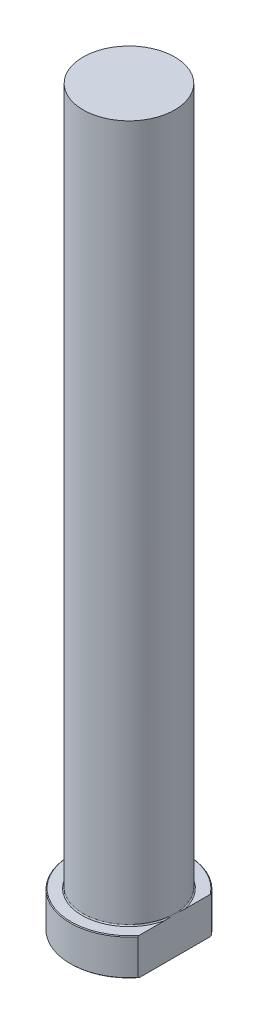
ISO-10303-21;
HEADER;
FILE_DESCRIPTION(('STEP AP214'),'2;1');
FILE_NAME('part.step','',(''),(''),'','','');
FILE_SCHEMA(('AUTOMOTIVE_DESIGN { 1 0 10303 214 1 1 1 1 }'));
ENDSEC;
DATA;
#1=APPLICATION_CONTEXT('core data for automotive mechanical design processes');
#2=APPLICATION_PROTOCOL_DEFINITION('international standard','automotive_design',2000,#1);
#3=PRODUCT_CONTEXT('',#1,'mechanical');
#4=PRODUCT('Part','Part','',(#3));
#5=PRODUCT_RELATED_PRODUCT_CATEGORY('part','',(#4));
#6=PRODUCT_DEFINITION_FORMATION('','',#4);
#7=PRODUCT_DEFINITION_CONTEXT('part definition',#1,'design');
#8=PRODUCT_DEFINITION('design','',#6,#7);
#9=PRODUCT_DEFINITION_SHAPE('','',#8);
#10=(LENGTH_UNIT() NAMED_UNIT(*) SI_UNIT(.MILLI.,.METRE.));
#11=(NAMED_UNIT(*) PLANE_ANGLE_UNIT() SI_UNIT($,.RADIAN.));
#12=(NAMED_UNIT(*) SI_UNIT($,.STERADIAN.) SOLID_ANGLE_UNIT());
#13=UNCERTAINTY_MEASURE_WITH_UNIT(LENGTH_MEASURE(1.E-05),#10,'distance_accuracy_value','');
#14=(GEOMETRIC_REPRESENTATION_CONTEXT(3) GLOBAL_UNCERTAINTY_ASSIGNED_CONTEXT((#13)) GLOBAL_UNIT_ASSIGNED_CONTEXT((#10,
#11,#12)) REPRESENTATION_CONTEXT('',''));
#15=CARTESIAN_POINT('',(0.,0.,0.));
#16=DIRECTION('',(0.,0.,1.));
#17=DIRECTION('',(1.,0.,0.));
#18=AXIS2_PLACEMENT_3D('',#15,#16,#17);
#19=CARTESIAN_POINT('',(0.,0.,0.));
#20=DIRECTION('',(0.,-1.,0.));
#21=DIRECTION('',(0.,0.,-1.));
#22=AXIS2_PLACEMENT_3D('',#19,#20,#21);
#23=PLANE('',#22);
#24=CARTESIAN_POINT('',(0.,0.,0.));
#25=DIRECTION('',(0.,-1.,0.));
#26=DIRECTION('',(0.,0.,-1.));
#27=AXIS2_PLACEMENT_3D('',#24,#25,#26);
#28=CIRCLE('',#27,15.8);
#29=CARTESIAN_POINT('',(12.5,0.,9.66385016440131));
#30=VERTEX_POINT('',#29);
#31=CARTESIAN_POINT('',(12.5,0.,-9.66385016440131));
#32=VERTEX_POINT('',#31);
#33=EDGE_CURVE('E98',#30,#32,#28,.T.);
#34=ORIENTED_EDGE('',*,*,#33,.T.);
#35=DIRECTION('',(0.,0.,1.));
#36=VECTOR('',#35,1.);
#37=CARTESIAN_POINT('',(12.5,0.,-9.98749217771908));
#38=LINE('',#37,#36);
#39=EDGE_CURVE('E83',#32,#30,#38,.T.);
#40=ORIENTED_EDGE('',*,*,#39,.T.);
#41=EDGE_LOOP('',(#34,#40));
#42=FACE_BOUND('',#41,.T.);
#43=ADVANCED_FACE('F32',(#42),#23,.T.);
#44=CARTESIAN_POINT('',(0.,259.958771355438,0.));
#45=DIRECTION('',(0.,1.,0.));
#46=DIRECTION('',(0.,0.,1.));
#47=AXIS2_PLACEMENT_3D('',#44,#45,#46);
#48=CYLINDRICAL_SURFACE('',#47,16.);
#49=CARTESIAN_POINT('',(0.,9.80000000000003,0.));
#50=DIRECTION('',(0.,1.,0.));
#51=DIRECTION('',(0.,0.,1.));
#52=AXIS2_PLACEMENT_3D('',#49,#50,#51);
#53=CIRCLE('',#52,16.);
#54=CARTESIAN_POINT('',(12.5,9.80000000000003,9.98749217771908));
#55=VERTEX_POINT('',#54);
#56=CARTESIAN_POINT('',(12.5,9.80000000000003,-9.98749217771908));
#57=VERTEX_POINT('',#56);
#58=EDGE_CURVE('E104',#55,#57,#53,.F.);
#59=ORIENTED_EDGE('',*,*,#58,.T.);
#60=DIRECTION('',(0.,-1.,0.));
#61=VECTOR('',#60,1.);
#62=CARTESIAN_POINT('',(12.5,200.,-9.98749217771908));
#63=LINE('',#62,#61);
#64=CARTESIAN_POINT('',(12.5,0.200000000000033,-9.98749217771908));
#65=VERTEX_POINT('',#64);
#66=EDGE_CURVE('E183',#57,#65,#63,.T.);
#67=ORIENTED_EDGE('',*,*,#66,.T.);
#68=CARTESIAN_POINT('',(0.,0.200000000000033,0.));
#69=DIRECTION('',(0.,-1.,0.));
#70=DIRECTION('',(0.,0.,-1.));
#71=AXIS2_PLACEMENT_3D('',#68,#69,#70);
#72=CIRCLE('',#71,16.);
#73=CARTESIAN_POINT('',(12.5,0.200000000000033,9.98749217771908));
#74=VERTEX_POINT('',#73);
#75=EDGE_CURVE('E100',#65,#74,#72,.F.);
#76=ORIENTED_EDGE('',*,*,#75,.T.);
#77=DIRECTION('',(0.,-1.,0.));
#78=VECTOR('',#77,1.);
#79=CARTESIAN_POINT('',(12.5,200.,9.98749217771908));
#80=LINE('',#79,#78);
#81=EDGE_CURVE('E93',#55,#74,#80,.T.);
#82=ORIENTED_EDGE('',*,*,#81,.F.);
#83=EDGE_LOOP('',(#59,#67,#76,#82));
#84=FACE_BOUND('',#83,.T.);
#85=ADVANCED_FACE('F158',(#84),#48,.T.);
#86=CARTESIAN_POINT('',(-16.,10.,0.));
#87=DIRECTION('',(0.,1.,0.));
#88=DIRECTION('',(0.,0.,1.));
#89=AXIS2_PLACEMENT_3D('',#86,#87,#88);
#90=PLANE('',#89);
#91=CARTESIAN_POINT('',(0.,10.,0.));
#92=DIRECTION('',(0.,1.,0.));
#93=DIRECTION('',(0.,0.,1.));
#94=AXIS2_PLACEMENT_3D('',#91,#92,#93);
#95=CIRCLE('',#94,15.8);
#96=CARTESIAN_POINT('',(12.5,10.,-9.66385016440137));
#97=VERTEX_POINT('',#96);
#98=CARTESIAN_POINT('',(12.5,10.,9.66385016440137));
#99=VERTEX_POINT('',#98);
#100=EDGE_CURVE('E178',#97,#99,#95,.T.);
#101=ORIENTED_EDGE('',*,*,#100,.T.);
#102=DIRECTION('',(0.,0.,-1.));
#103=VECTOR('',#102,1.);
#104=CARTESIAN_POINT('',(12.5,10.,0.));
#105=LINE('',#104,#103);
#106=CARTESIAN_POINT('',(12.5,10.,2.75499546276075));
#107=VERTEX_POINT('',#106);
#108=EDGE_CURVE('E57',#99,#107,#105,.T.);
#109=ORIENTED_EDGE('',*,*,#108,.T.);
#110=CARTESIAN_POINT('',(0.,10.,0.));
#111=DIRECTION('',(0.,1.,0.));
#112=DIRECTION('',(0.,0.,1.));
#113=AXIS2_PLACEMENT_3D('',#110,#111,#112);
#114=CIRCLE('',#113,12.8);
#115=CARTESIAN_POINT('',(12.5,10.,-2.75499546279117));
#116=VERTEX_POINT('',#115);
#117=EDGE_CURVE('E107',#107,#116,#114,.F.);
#118=ORIENTED_EDGE('',*,*,#117,.T.);
#119=EDGE_CURVE('E136',#116,#97,#105,.T.);
#120=ORIENTED_EDGE('',*,*,#119,.T.);
#121=EDGE_LOOP('',(#101,#109,#118,#120));
#122=FACE_BOUND('',#121,.T.);
#123=ADVANCED_FACE('F147',(#122),#90,.T.);
#124=CARTESIAN_POINT('',(0.,10.,0.));
#125=DIRECTION('',(0.,-1.,0.));
#126=DIRECTION('',(0.,0.,-1.));
#127=AXIS2_PLACEMENT_3D('',#124,#125,#126);
#128=CONICAL_SURFACE('',#127,15.8,0.785398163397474);
#129=ORIENTED_EDGE('',*,*,#58,.F.);
#130=CARTESIAN_POINT('',(12.5,0.520063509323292,21.9732835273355));
#131=CARTESIAN_POINT('',(12.5,0.802025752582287,21.6488770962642));
#132=CARTESIAN_POINT('',(12.5,1.08313217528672,21.3237240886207));
#133=CARTESIAN_POINT('',(12.5,1.64338244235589,20.6717229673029));
#134=CARTESIAN_POINT('',(12.5,1.92252625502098,20.3448748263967));
#135=CARTESIAN_POINT('',(12.5,2.47872061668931,19.689139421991));
#136=CARTESIAN_POINT('',(12.5,2.75577013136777,19.3602512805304));
#137=CARTESIAN_POINT('',(12.5,3.30732757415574,18.7003513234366));
#138=CARTESIAN_POINT('',(12.5,3.58183551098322,18.3693395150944));
#139=CARTESIAN_POINT('',(12.5,4.13404626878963,17.6974852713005));
#140=CARTESIAN_POINT('',(12.5,4.41168315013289,17.3565885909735));
#141=CARTESIAN_POINT('',(12.5,4.96342557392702,16.6719500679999));
#142=CARTESIAN_POINT('',(12.5,5.23753113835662,16.3282082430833));
#143=CARTESIAN_POINT('',(12.5,5.78155974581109,15.6375575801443));
#144=CARTESIAN_POINT('',(12.5,6.05148375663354,15.2906495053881));
#145=CARTESIAN_POINT('',(12.5,6.58649101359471,14.5931154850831));
#146=CARTESIAN_POINT('',(12.5,6.85157426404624,14.2424895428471));
#147=CARTESIAN_POINT('',(12.5,7.37633965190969,13.5365100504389));
#148=CARTESIAN_POINT('',(12.5,7.63601439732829,13.1811509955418));
#149=CARTESIAN_POINT('',(12.5,8.14848411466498,12.4654890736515));
#150=CARTESIAN_POINT('',(12.5,8.4012790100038,12.1051861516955));
#151=CARTESIAN_POINT('',(12.5,8.89877262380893,11.3785626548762));
#152=CARTESIAN_POINT('',(12.5,9.14346420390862,11.0122371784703));
#153=CARTESIAN_POINT('',(12.5,9.62269650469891,10.272992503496));
#154=CARTESIAN_POINT('',(12.5,9.85723744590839,9.90007344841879));
#155=CARTESIAN_POINT('',(12.5,10.3121733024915,9.14938704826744));
#156=CARTESIAN_POINT('',(12.5,10.5326589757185,8.77167495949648));
#157=CARTESIAN_POINT('',(12.5,10.9584323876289,8.00766886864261));
#158=CARTESIAN_POINT('',(12.5,11.1637182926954,7.62137383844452));
#159=CARTESIAN_POINT('',(12.5,11.5550521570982,6.83979556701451));
#160=CARTESIAN_POINT('',(12.5,11.7411279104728,6.44452635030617));
#161=CARTESIAN_POINT('',(12.5,12.0896891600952,5.64379531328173));
#162=CARTESIAN_POINT('',(12.5,12.2521837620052,5.23833749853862));
#163=CARTESIAN_POINT('',(12.5,12.5515074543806,4.40750298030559));
#164=CARTESIAN_POINT('',(12.5,12.6876692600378,3.98188300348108));
#165=CARTESIAN_POINT('',(12.5,12.9230664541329,3.1203601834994));
#166=CARTESIAN_POINT('',(12.5,13.0223077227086,2.68445898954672));
#167=CARTESIAN_POINT('',(12.5,13.1386499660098,2.02637177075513));
#168=CARTESIAN_POINT('',(12.5,13.1719581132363,1.80697979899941));
#169=CARTESIAN_POINT('',(12.5,13.2273896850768,1.36679892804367));
#170=CARTESIAN_POINT('',(12.5,13.2495147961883,1.14601024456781));
#171=CARTESIAN_POINT('',(12.5,13.2821590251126,0.703578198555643));
#172=CARTESIAN_POINT('',(12.5,13.2926782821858,0.481934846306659));
#173=CARTESIAN_POINT('',(12.5,13.3019073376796,0.0383999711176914));
#174=CARTESIAN_POINT('',(12.5,13.3006171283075,-0.183491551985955));
#175=CARTESIAN_POINT('',(12.5,13.2862386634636,-0.627300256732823));
#176=CARTESIAN_POINT('',(12.5,13.2731286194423,-0.849216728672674));
#177=CARTESIAN_POINT('',(12.5,13.2353379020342,-1.29205679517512));
#178=CARTESIAN_POINT('',(12.5,13.2106571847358,-1.51298038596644));
#179=CARTESIAN_POINT('',(12.5,13.1501829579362,-1.9533130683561));
#180=CARTESIAN_POINT('',(12.5,13.1143886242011,-2.17272204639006));
#181=CARTESIAN_POINT('',(12.5,13.0323124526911,-2.60958138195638));
#182=CARTESIAN_POINT('',(12.5,12.9860290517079,-2.82703144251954));
#183=CARTESIAN_POINT('',(12.5,12.8318007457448,-3.47896053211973));
#184=CARTESIAN_POINT('',(12.5,12.7089145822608,-3.90995974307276));
#185=CARTESIAN_POINT('',(12.5,12.4301044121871,-4.76088311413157));
#186=CARTESIAN_POINT('',(12.5,12.2741797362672,-5.18080704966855));
#187=CARTESIAN_POINT('',(12.5,11.899855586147,-6.09704545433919));
#188=CARTESIAN_POINT('',(12.5,11.6752155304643,-6.59079268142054));
#189=CARTESIAN_POINT('',(12.5,11.1959254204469,-7.56361802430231));
#190=CARTESIAN_POINT('',(12.5,10.9412581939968,-8.04268754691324));
#191=CARTESIAN_POINT('',(12.5,10.408564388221,-8.98884891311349));
#192=CARTESIAN_POINT('',(12.5,10.1304909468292,-9.45591416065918));
#193=CARTESIAN_POINT('',(12.5,9.55679554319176,-10.3789360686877));
#194=CARTESIAN_POINT('',(12.5,9.26117703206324,-10.8348948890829));
#195=CARTESIAN_POINT('',(12.5,8.65460060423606,-11.7400212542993));
#196=CARTESIAN_POINT('',(12.5,8.34356847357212,-12.1891388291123));
#197=CARTESIAN_POINT('',(12.5,7.71056360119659,-13.0795913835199));
#198=CARTESIAN_POINT('',(12.5,7.38859046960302,-13.5209260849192));
#199=CARTESIAN_POINT('',(12.5,6.7362707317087,-14.3965599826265));
#200=CARTESIAN_POINT('',(12.5,6.4059341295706,-14.8308666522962));
#201=CARTESIAN_POINT('',(12.5,5.73818513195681,-15.69398428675));
#202=CARTESIAN_POINT('',(12.5,5.40077283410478,-16.1227953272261));
#203=CARTESIAN_POINT('',(12.5,4.69065889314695,-17.0127103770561));
#204=CARTESIAN_POINT('',(12.5,4.31743190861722,-17.473394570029));
#205=CARTESIAN_POINT('',(12.5,3.56536441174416,-18.3901509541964));
#206=CARTESIAN_POINT('',(12.5,3.18652389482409,-18.8462231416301));
#207=CARTESIAN_POINT('',(12.5,2.42850462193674,-19.7493414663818));
#208=CARTESIAN_POINT('',(12.5,2.04937794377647,-20.1964313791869));
#209=CARTESIAN_POINT('',(12.5,1.28737664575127,-21.0872319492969));
#210=CARTESIAN_POINT('',(12.5,0.904502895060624,-21.5309433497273));
#211=CARTESIAN_POINT('',(12.5,0.520063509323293,-21.9732835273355));
#212=B_SPLINE_CURVE_WITH_KNOTS('',3,(#130,#131,#132,#133,#134,#135,#136,#137,#138,#139,#140,
#141,#142,#143,#144,#145,#146,#147,#148,#149,#150,#151,#152,#153,#154,#155,#156,#157,#158,#159,
#160,#161,#162,#163,#164,#165,#166,#167,#168,#169,#170,#171,#172,#173,#174,#175,#176,#177,#178,
#179,#180,#181,#182,#183,#184,#185,#186,#187,#188,#189,#190,#191,#192,#193,#194,#195,#196,#197,
#198,#199,#200,#201,#202,#203,#204,#205,#206,#207,#208,#209,#210,#211),.UNSPECIFIED.,.F.,.F.,(4,
2,2,2,2,2,2,2,2,2,2,2,2,2,2,2,2,2,2,2,2,2,2,2,2,2,2,2,2,2,2,2,2,2,2,2,2,2,2,2,4),(0.,
1.28945110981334,2.57892299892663,3.86899482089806,5.15906221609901,6.47799420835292,
7.79691798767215,9.11553180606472,10.4341444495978,11.7544545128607,13.0747792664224,
14.3962377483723,15.7176675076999,17.0294519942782,18.3413944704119,19.6514113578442,
20.9609210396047,22.3001940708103,23.6392537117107,24.3047314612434,24.9701088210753,
25.6354781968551,26.3008480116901,26.9674468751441,27.6340482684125,28.3006991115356,
28.9674493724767,30.3101828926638,31.6529436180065,33.2788964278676,34.9057836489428,
36.5360093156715,38.1659153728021,39.804623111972,41.4433893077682,43.0802801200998,
44.7171483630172,46.4957886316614,48.2744303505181,50.0329971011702,51.7911651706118),.UNSPECIFIED.);
#213=EDGE_CURVE('E135',#55,#99,#212,.T.);
#214=ORIENTED_EDGE('',*,*,#213,.T.);
#215=ORIENTED_EDGE('',*,*,#100,.F.);
#216=EDGE_CURVE('E127',#97,#57,#212,.T.);
#217=ORIENTED_EDGE('',*,*,#216,.T.);
#218=EDGE_LOOP('',(#129,#214,#215,#217));
#219=FACE_BOUND('',#218,.T.);
#220=ADVANCED_FACE('F143',(#219),#128,.T.);
#221=CARTESIAN_POINT('',(0.,0.200000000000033,0.));
#222=DIRECTION('',(0.,1.,0.));
#223=DIRECTION('',(0.,0.,1.));
#224=AXIS2_PLACEMENT_3D('',#221,#222,#223);
#225=CONICAL_SURFACE('',#224,16.,0.785398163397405);
#226=ORIENTED_EDGE('',*,*,#75,.F.);
#227=CARTESIAN_POINT('',(12.5,9.47993649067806,-21.9732835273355));
#228=CARTESIAN_POINT('',(12.5,9.19797424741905,-21.6488770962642));
#229=CARTESIAN_POINT('',(12.5,8.9168678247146,-21.3237240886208));
#230=CARTESIAN_POINT('',(12.5,8.35661755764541,-20.6717229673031));
#231=CARTESIAN_POINT('',(12.5,8.0774737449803,-20.3448748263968));
#232=CARTESIAN_POINT('',(12.5,7.52127938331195,-19.6891394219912));
#233=CARTESIAN_POINT('',(12.5,7.24422986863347,-19.3602512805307));
#234=CARTESIAN_POINT('',(12.5,6.69267242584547,-18.7003513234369));
#235=CARTESIAN_POINT('',(12.5,6.41816448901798,-18.3693395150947));
#236=CARTESIAN_POINT('',(12.5,5.86595373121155,-17.6974852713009));
#237=CARTESIAN_POINT('',(12.5,5.58831684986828,-17.356588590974));
#238=CARTESIAN_POINT('',(12.5,5.03657442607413,-16.6719500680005));
#239=CARTESIAN_POINT('',(12.5,4.76246886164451,-16.3282082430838));
#240=CARTESIAN_POINT('',(12.5,4.21844025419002,-15.6375575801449));
#241=CARTESIAN_POINT('',(12.5,3.94851624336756,-15.2906495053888));
#242=CARTESIAN_POINT('',(12.5,3.41350898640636,-14.5931154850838));
#243=CARTESIAN_POINT('',(12.5,3.14842573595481,-14.2424895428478));
#244=CARTESIAN_POINT('',(12.5,2.62366034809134,-13.5365100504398));
#245=CARTESIAN_POINT('',(12.5,2.36398560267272,-13.1811509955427));
#246=CARTESIAN_POINT('',(12.5,1.851515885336,-12.4654890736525));
#247=CARTESIAN_POINT('',(12.5,1.59872098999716,-12.1051861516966));
#248=CARTESIAN_POINT('',(12.5,1.10122737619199,-11.3785626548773));
#249=CARTESIAN_POINT('',(12.5,0.856535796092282,-11.0122371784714));
#250=CARTESIAN_POINT('',(12.5,0.377303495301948,-10.2729925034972));
#251=CARTESIAN_POINT('',(12.5,0.142762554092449,-9.90007344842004));
#252=CARTESIAN_POINT('',(12.5,-0.312173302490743,-9.14938704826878));
#253=CARTESIAN_POINT('',(12.5,-0.532658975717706,-8.77167495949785));
#254=CARTESIAN_POINT('',(12.5,-0.958432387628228,-8.00766886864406));
#255=CARTESIAN_POINT('',(12.5,-1.16371829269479,-7.62137383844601));
#256=CARTESIAN_POINT('',(12.5,-1.55505215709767,-6.83979556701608));
#257=CARTESIAN_POINT('',(12.5,-1.74112791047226,-6.44452635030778));
#258=CARTESIAN_POINT('',(12.5,-2.08968916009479,-5.64379531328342));
#259=CARTESIAN_POINT('',(12.5,-2.25218376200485,-5.23833749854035));
#260=CARTESIAN_POINT('',(12.5,-2.55150745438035,-4.4075029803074));
#261=CARTESIAN_POINT('',(12.5,-2.6876692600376,-3.98188300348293));
#262=CARTESIAN_POINT('',(12.5,-2.92306645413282,-3.12036018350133));
#263=CARTESIAN_POINT('',(12.5,-3.02230772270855,-2.68445898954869));
#264=CARTESIAN_POINT('',(12.5,-3.13864996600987,-2.02637177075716));
#265=CARTESIAN_POINT('',(12.5,-3.17195811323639,-1.80697979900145));
#266=CARTESIAN_POINT('',(12.5,-3.22738968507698,-1.36679892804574));
#267=CARTESIAN_POINT('',(12.5,-3.24951479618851,-1.1460102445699));
#268=CARTESIAN_POINT('',(12.5,-3.28215902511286,-0.703578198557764));
#269=CARTESIAN_POINT('',(12.5,-3.29267828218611,-0.481934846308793));
#270=CARTESIAN_POINT('',(12.5,-3.30190733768,-0.0383999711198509));
#271=CARTESIAN_POINT('',(12.5,-3.30061712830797,0.183491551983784));
#272=CARTESIAN_POINT('',(12.5,-3.28623866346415,0.627300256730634));
#273=CARTESIAN_POINT('',(12.5,-3.27312861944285,0.849216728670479));
#274=CARTESIAN_POINT('',(12.5,-3.2353379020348,1.29205679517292));
#275=CARTESIAN_POINT('',(12.5,-3.21065718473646,1.51298038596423));
#276=CARTESIAN_POINT('',(12.5,-3.15018295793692,1.95331306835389));
#277=CARTESIAN_POINT('',(12.5,-3.11438862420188,2.17272204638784));
#278=CARTESIAN_POINT('',(12.5,-3.03231245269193,2.60958138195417));
#279=CARTESIAN_POINT('',(12.5,-2.98602905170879,2.82703144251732));
#280=CARTESIAN_POINT('',(12.5,-2.83180074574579,3.4789605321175));
#281=CARTESIAN_POINT('',(12.5,-2.70891458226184,3.90995974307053));
#282=CARTESIAN_POINT('',(12.5,-2.43010441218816,4.76088311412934));
#283=CARTESIAN_POINT('',(12.5,-2.27417973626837,5.18080704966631));
#284=CARTESIAN_POINT('',(12.5,-1.89985558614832,6.09704545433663));
#285=CARTESIAN_POINT('',(12.5,-1.67521553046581,6.59079268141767));
#286=CARTESIAN_POINT('',(12.5,-1.19592542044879,7.56361802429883));
#287=CARTESIAN_POINT('',(12.5,-0.941258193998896,8.04268754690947));
#288=CARTESIAN_POINT('',(12.5,-0.408564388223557,8.98884891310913));
#289=CARTESIAN_POINT('',(12.5,-0.130490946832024,9.45591416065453));
#290=CARTESIAN_POINT('',(12.5,0.443204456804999,10.3789360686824));
#291=CARTESIAN_POINT('',(12.5,0.738822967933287,10.8348948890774));
#292=CARTESIAN_POINT('',(12.5,1.34539939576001,11.7400212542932));
#293=CARTESIAN_POINT('',(12.5,1.65643152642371,12.1891388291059));
#294=CARTESIAN_POINT('',(12.5,2.28943639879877,13.079591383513));
#295=CARTESIAN_POINT('',(12.5,2.61140953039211,13.520926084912));
#296=CARTESIAN_POINT('',(12.5,3.26372926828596,14.3965599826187));
#297=CARTESIAN_POINT('',(12.5,3.59406587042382,14.8308666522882));
#298=CARTESIAN_POINT('',(12.5,4.26181486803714,15.6939842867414));
#299=CARTESIAN_POINT('',(12.5,4.59922716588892,16.1227953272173));
#300=CARTESIAN_POINT('',(12.5,5.30934110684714,17.0127103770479));
#301=CARTESIAN_POINT('',(12.5,5.68256809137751,17.4733945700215));
#302=CARTESIAN_POINT('',(12.5,6.43463558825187,18.3901509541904));
#303=CARTESIAN_POINT('',(12.5,6.81347610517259,18.846223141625));
#304=CARTESIAN_POINT('',(12.5,7.57149537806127,19.7493414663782));
#305=CARTESIAN_POINT('',(12.5,7.95062205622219,20.196431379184));
#306=CARTESIAN_POINT('',(12.5,8.71262335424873,21.0872319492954));
#307=CARTESIAN_POINT('',(12.5,9.09549710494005,21.5309433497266));
#308=CARTESIAN_POINT('',(12.5,9.47993649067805,21.9732835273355));
#309=B_SPLINE_CURVE_WITH_KNOTS('',3,(#227,#228,#229,#230,#231,#232,#233,#234,#235,#236,#237,
#238,#239,#240,#241,#242,#243,#244,#245,#246,#247,#248,#249,#250,#251,#252,#253,#254,#255,#256,
#257,#258,#259,#260,#261,#262,#263,#264,#265,#266,#267,#268,#269,#270,#271,#272,#273,#274,#275,
#276,#277,#278,#279,#280,#281,#282,#283,#284,#285,#286,#287,#288,#289,#290,#291,#292,#293,#294,
#295,#296,#297,#298,#299,#300,#301,#302,#303,#304,#305,#306,#307,#308),.UNSPECIFIED.,.F.,.F.,(4,
2,2,2,2,2,2,2,2,2,2,2,2,2,2,2,2,2,2,2,2,2,2,2,2,2,2,2,2,2,2,2,2,2,2,2,2,2,2,2,4),(0.,
1.28945110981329,2.57892299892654,3.86899482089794,5.15906221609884,6.47799420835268,
7.79691798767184,9.11553180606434,10.4341444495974,11.7544545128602,13.0747792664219,
14.3962377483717,15.7176675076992,17.0294519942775,18.3413944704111,19.6514113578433,
20.9609210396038,22.3001940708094,23.6392537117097,24.3047314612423,24.9701088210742,
25.635478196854,26.3008480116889,26.9674468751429,27.6340482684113,28.3006991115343,
28.9674493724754,30.3101828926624,31.6529436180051,33.2788964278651,34.9057836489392,
36.5360093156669,38.1659153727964,39.8046231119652,41.4433893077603,43.0802801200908,
44.7171483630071,46.4957886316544,48.2744303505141,50.0329971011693,51.7911651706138),.UNSPECIFIED.);
#310=EDGE_CURVE('E86',#65,#32,#309,.T.);
#311=ORIENTED_EDGE('',*,*,#310,.T.);
#312=ORIENTED_EDGE('',*,*,#33,.F.);
#313=EDGE_CURVE('E89',#30,#74,#309,.T.);
#314=ORIENTED_EDGE('',*,*,#313,.T.);
#315=EDGE_LOOP('',(#226,#311,#312,#314));
#316=FACE_BOUND('',#315,.T.);
#317=ADVANCED_FACE('F97',(#316),#225,.T.);
#318=CARTESIAN_POINT('',(0.,10.3,0.));
#319=DIRECTION('',(0.,1.,0.));
#320=DIRECTION('',(0.,0.,1.));
#321=AXIS2_PLACEMENT_3D('',#318,#319,#320);
#322=TOROIDAL_SURFACE('',#321,12.8,0.3);
#323=CARTESIAN_POINT('',(12.5,10.3,0.));
#324=CARTESIAN_POINT('',(12.5,10.300000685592,-6.08820746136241E-09));
#325=CARTESIAN_POINT('',(12.5,10.300001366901,-5.08876655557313E-07));
#326=CARTESIAN_POINT('',(12.5,10.3000026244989,-1.73661802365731E-06));
#327=CARTESIAN_POINT('',(12.5,10.3000031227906,-2.48490474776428E-06));
#328=CARTESIAN_POINT('',(12.5,10.3000042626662,-4.35291163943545E-06));
#329=CARTESIAN_POINT('',(12.5,10.3000048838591,-5.50325566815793E-06));
#330=CARTESIAN_POINT('',(12.5,10.3000058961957,-7.76527023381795E-06));
#331=CARTESIAN_POINT('',(12.5,10.3000063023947,-8.87193032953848E-06));
#332=CARTESIAN_POINT('',(12.5,10.3000080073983,-1.35535117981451E-05));
#333=CARTESIAN_POINT('',(12.5,10.300009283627,-1.71478698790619E-05));
#334=CARTESIAN_POINT('',(12.5,10.3000111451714,-2.39305737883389E-05));
#335=CARTESIAN_POINT('',(12.5,10.30001180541,-2.70989461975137E-05));
#336=CARTESIAN_POINT('',(12.5,10.3000165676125,-5.05411717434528E-05));
#337=CARTESIAN_POINT('',(12.5,10.3000200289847,-7.09185071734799E-05));
#338=CARTESIAN_POINT('',(12.5,10.300032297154,-0.000151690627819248));
#339=CARTESIAN_POINT('',(12.5,10.3000383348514,-0.000212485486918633));
#340=CARTESIAN_POINT('',(12.5,10.3000659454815,-0.000448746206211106));
#341=CARTESIAN_POINT('',(12.5,10.3000952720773,-0.000623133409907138));
#342=CARTESIAN_POINT('',(12.5,10.3002039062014,-0.00128772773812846));
#343=CARTESIAN_POINT('',(12.5,10.3002776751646,-0.00177866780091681));
#344=CARTESIAN_POINT('',(12.5,10.3005641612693,-0.00366503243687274));
#345=CARTESIAN_POINT('',(12.5,10.3007823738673,-0.00505974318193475));
#346=CARTESIAN_POINT('',(12.5,10.3018133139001,-0.0116680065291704));
#347=CARTESIAN_POINT('',(12.5,10.3026180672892,-0.0168825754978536));
#348=CARTESIAN_POINT('',(12.5,10.3120514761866,-0.0779781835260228));
#349=CARTESIAN_POINT('',(12.5,10.3207244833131,-0.133853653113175));
#350=CARTESIAN_POINT('',(12.5,10.3388658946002,-0.251282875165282));
#351=CARTESIAN_POINT('',(12.5,10.3483257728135,-0.312837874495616));
#352=CARTESIAN_POINT('',(12.5,10.3639287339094,-0.415046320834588));
#353=CARTESIAN_POINT('',(12.5,10.3701065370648,-0.455694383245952));
#354=CARTESIAN_POINT('',(12.5,10.3822268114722,-0.53596333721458));
#355=CARTESIAN_POINT('',(12.5,10.3881712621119,-0.57558393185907));
#356=CARTESIAN_POINT('',(12.5,10.4217048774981,-0.800849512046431));
#357=CARTESIAN_POINT('',(12.5,10.4483430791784,-0.986638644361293));
#358=CARTESIAN_POINT('',(12.5,10.4978676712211,-1.36073085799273));
#359=CARTESIAN_POINT('',(12.5,10.5207116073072,-1.54903981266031));
#360=CARTESIAN_POINT('',(12.5,10.5510813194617,-1.84372746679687));
#361=CARTESIAN_POINT('',(12.5,10.5609338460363,-1.94986334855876));
#362=CARTESIAN_POINT('',(12.5,10.5778401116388,-2.16235517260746));
#363=CARTESIAN_POINT('',(12.5,10.5848941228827,-2.26871109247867));
#364=CARTESIAN_POINT('',(12.5,10.5953321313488,-2.48120575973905));
#365=CARTESIAN_POINT('',(12.5,10.5987299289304,-2.58734380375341));
#366=CARTESIAN_POINT('',(12.5,10.6006981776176,-2.79965289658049));
#367=CARTESIAN_POINT('',(12.5,10.5992708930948,-2.90582390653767));
#368=CARTESIAN_POINT('',(12.5,10.5920660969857,-3.06242328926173));
#369=CARTESIAN_POINT('',(12.5,10.5889531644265,-3.11297361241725));
#370=CARTESIAN_POINT('',(12.5,10.5807735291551,-3.21396863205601));
#371=CARTESIAN_POINT('',(12.5,10.5757051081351,-3.26441319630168));
#372=CARTESIAN_POINT('',(12.5,10.5631618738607,-3.36425835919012));
#373=CARTESIAN_POINT('',(12.5,10.555723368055,-3.41366343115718));
#374=CARTESIAN_POINT('',(12.5,10.5375916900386,-3.51185380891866));
#375=CARTESIAN_POINT('',(12.5,10.5269024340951,-3.56063978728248));
#376=CARTESIAN_POINT('',(12.5,10.5054348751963,-3.6391830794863));
#377=CARTESIAN_POINT('',(12.5,10.4961365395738,-3.66933696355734));
#378=CARTESIAN_POINT('',(12.5,10.474763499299,-3.72862196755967));
#379=CARTESIAN_POINT('',(12.5,10.462694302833,-3.75775498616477));
#380=CARTESIAN_POINT('',(12.5,10.4380385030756,-3.80618627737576));
#381=CARTESIAN_POINT('',(12.5,10.4265070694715,-3.8259857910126));
#382=CARTESIAN_POINT('',(12.5,10.4063926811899,-3.85382979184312));
#383=CARTESIAN_POINT('',(12.5,10.3991733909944,-3.8628437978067));
#384=CARTESIAN_POINT('',(12.5,10.3835233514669,-3.87975615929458));
#385=CARTESIAN_POINT('',(12.5,10.3750969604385,-3.88765833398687));
#386=CARTESIAN_POINT('',(12.5,10.3611065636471,-3.89824999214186));
#387=CARTESIAN_POINT('',(12.5,10.3560749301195,-3.9016366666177));
#388=CARTESIAN_POINT('',(12.5,10.3455861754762,-3.90768435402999));
#389=CARTESIAN_POINT('',(12.5,10.3401292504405,-3.91034569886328));
#390=CARTESIAN_POINT('',(12.5,10.3287657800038,-3.91474619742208));
#391=CARTESIAN_POINT('',(12.5,10.3228544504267,-3.91647335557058));
#392=CARTESIAN_POINT('',(12.5,10.3108092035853,-3.91873417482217));
#393=CARTESIAN_POINT('',(12.5,10.3046756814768,-3.91926985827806));
#394=CARTESIAN_POINT('',(12.5,10.293185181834,-3.91908606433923));
#395=CARTESIAN_POINT('',(12.5,10.2878253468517,-3.91851265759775));
#396=CARTESIAN_POINT('',(12.5,10.2772818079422,-3.91645967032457));
#397=CARTESIAN_POINT('',(12.5,10.2720982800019,-3.91497921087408));
#398=CARTESIAN_POINT('',(12.5,10.2604757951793,-3.91068184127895));
#399=CARTESIAN_POINT('',(12.5,10.2541380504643,-3.90759459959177));
#400=CARTESIAN_POINT('',(12.5,10.2420308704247,-3.90046137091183));
#401=CARTESIAN_POINT('',(12.5,10.2362627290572,-3.89641326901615));
#402=CARTESIAN_POINT('',(12.5,10.2213149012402,-3.88449159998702));
#403=CARTESIAN_POINT('',(12.5,10.2126659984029,-3.87596096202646));
#404=CARTESIAN_POINT('',(12.5,10.1966439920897,-3.85778795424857));
#405=CARTESIAN_POINT('',(12.5,10.1892747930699,-3.84814232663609));
#406=CARTESIAN_POINT('',(12.5,10.1725709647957,-3.82389784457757));
#407=CARTESIAN_POINT('',(12.5,10.1637497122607,-3.80894948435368));
#408=CARTESIAN_POINT('',(12.5,10.1475318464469,-3.77828784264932));
#409=CARTESIAN_POINT('',(12.5,10.1401383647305,-3.76257297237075));
#410=CARTESIAN_POINT('',(12.5,10.1264047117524,-3.73059893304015));
#411=CARTESIAN_POINT('',(12.5,10.1200701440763,-3.71433738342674));
#412=CARTESIAN_POINT('',(12.5,10.1082745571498,-3.68152468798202));
#413=CARTESIAN_POINT('',(12.5,10.1028126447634,-3.66497385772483));
#414=CARTESIAN_POINT('',(12.5,10.0886990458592,-3.61898372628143));
#415=CARTESIAN_POINT('',(12.5,10.0807822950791,-3.58931942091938));
#416=CARTESIAN_POINT('',(12.5,10.0665587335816,-3.52960268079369));
#417=CARTESIAN_POINT('',(12.5,10.0602528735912,-3.49955002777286));
#418=CARTESIAN_POINT('',(12.5,10.0432020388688,-3.40892020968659));
#419=CARTESIAN_POINT('',(12.5,10.0343558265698,-3.34798718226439));
#420=CARTESIAN_POINT('',(12.5,10.0201228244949,-3.22565891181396));
#421=CARTESIAN_POINT('',(12.5,10.0147414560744,-3.16426309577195));
#422=CARTESIAN_POINT('',(12.5,10.0066240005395,-3.04138251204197));
#423=CARTESIAN_POINT('',(12.5,10.0038844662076,-2.97989796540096));
#424=CARTESIAN_POINT('',(12.5,10.0005131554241,-2.8577235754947));
#425=CARTESIAN_POINT('',(12.5,9.99985290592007,-2.79703443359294));
#426=CARTESIAN_POINT('',(12.5,10.0002004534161,-2.67565900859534));
#427=CARTESIAN_POINT('',(12.5,10.0012083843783,-2.61497272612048));
#428=CARTESIAN_POINT('',(12.5,10.0063170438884,-2.43292800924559));
#429=CARTESIAN_POINT('',(12.5,10.0125034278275,-2.31162822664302));
#430=CARTESIAN_POINT('',(12.5,10.028923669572,-2.06913309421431));
#431=CARTESIAN_POINT('',(12.5,10.0391638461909,-1.94793820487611));
#432=CARTESIAN_POINT('',(12.5,10.0626694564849,-1.70583328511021));
#433=CARTESIAN_POINT('',(12.5,10.0759352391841,-1.58492328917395));
#434=CARTESIAN_POINT('',(12.5,10.1189883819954,-1.22310927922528));
#435=CARTESIAN_POINT('',(12.5,10.1520738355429,-0.982605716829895));
#436=CARTESIAN_POINT('',(12.5,10.2222679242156,-0.502161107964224));
#437=CARTESIAN_POINT('',(12.5,10.2593775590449,-0.262220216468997));
#438=CARTESIAN_POINT('',(12.5,10.2965571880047,-0.0222236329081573));
#439=CARTESIAN_POINT('',(12.5,10.2965669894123,-0.0221603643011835));
#440=CARTESIAN_POINT('',(12.5,10.2972687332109,-0.017630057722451));
#441=CARTESIAN_POINT('',(12.5,10.2979552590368,-0.0131622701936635));
#442=CARTESIAN_POINT('',(12.5,10.2989608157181,-0.00672404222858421));
#443=CARTESIAN_POINT('',(12.5,10.2992709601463,-0.00475237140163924));
#444=CARTESIAN_POINT('',(12.5,10.299665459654,-0.00214447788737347));
#445=CARTESIAN_POINT('',(12.5,10.299760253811,-0.0015097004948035));
#446=CARTESIAN_POINT('',(12.5,10.2998957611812,-0.000678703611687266));
#447=CARTESIAN_POINT('',(12.5,10.2999287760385,-0.000481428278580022));
#448=CARTESIAN_POINT('',(12.5,10.2999592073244,-0.000219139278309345));
#449=CARTESIAN_POINT('',(12.5,10.2999655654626,-0.000155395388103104));
#450=CARTESIAN_POINT('',(12.5,10.2999789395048,-7.14631131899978E-05));
#451=CARTESIAN_POINT('',(12.5,10.2999826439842,-5.07827878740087E-05));
#452=CARTESIAN_POINT('',(12.5,10.2999877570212,-2.70484026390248E-05));
#453=CARTESIAN_POINT('',(12.5,10.2999884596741,-2.3870209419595E-05));
#454=CARTESIAN_POINT('',(12.5,10.2999904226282,-1.70721258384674E-05));
#455=CARTESIAN_POINT('',(12.5,10.2999917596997,-1.34738016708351E-05));
#456=CARTESIAN_POINT('',(12.5,10.2999935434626,-8.79208554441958E-06));
#457=CARTESIAN_POINT('',(12.5,10.2999939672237,-7.68838220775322E-06));
#458=CARTESIAN_POINT('',(12.5,10.2999950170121,-5.43535458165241E-06));
#459=CARTESIAN_POINT('',(12.5,10.2999956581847,-4.29133306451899E-06));
#460=CARTESIAN_POINT('',(12.5,10.2999968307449,-2.43685216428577E-06));
#461=CARTESIAN_POINT('',(12.5,10.29999734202,-1.69517537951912E-06));
#462=CARTESIAN_POINT('',(12.5,10.2999986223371,-4.8608665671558E-07));
#463=CARTESIAN_POINT('',(12.5,10.2999993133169,6.09789656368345E-09));
#464=CARTESIAN_POINT('',(12.5,10.3,0.));
#465=B_SPLINE_CURVE_WITH_KNOTS('',3,(#323,#324,#325,#326,#327,#328,#329,#330,#331,#332,#333,
#334,#335,#336,#337,#338,#339,#340,#341,#342,#343,#344,#345,#346,#347,#348,#349,#350,#351,#352,
#353,#354,#355,#356,#357,#358,#359,#360,#361,#362,#363,#364,#365,#366,#367,#368,#369,#370,#371,
#372,#373,#374,#375,#376,#377,#378,#379,#380,#381,#382,#383,#384,#385,#386,#387,#388,#389,#390,
#391,#392,#393,#394,#395,#396,#397,#398,#399,#400,#401,#402,#403,#404,#405,#406,#407,#408,#409,
#410,#411,#412,#413,#414,#415,#416,#417,#418,#419,#420,#421,#422,#423,#424,#425,#426,#427,#428,
#429,#430,#431,#432,#433,#434,#435,#436,#437,#438,#439,#440,#441,#442,#443,#444,#445,#446,#447,
#448,#449,#450,#451,#452,#453,#454,#455,#456,#457,#458,#459,#460,#461,#462,#463,#464),
.UNSPECIFIED.,.T.,.F.,(4,2,2,2,2,2,2,2,2,2,2,2,2,2,2,2,2,2,2,2,2,2,2,2,2,2,2,2,2,2,2,2,2,2,2,2,
2,2,2,2,2,2,2,2,2,2,2,2,2,2,2,2,2,2,2,2,2,2,2,2,2,2,2,2,2,2,2,2,2,2,4),(0.,2.18904227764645E-06,
4.96900724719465E-06,8.83863216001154E-06,1.23796733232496E-05,2.37905621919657E-05,
3.34897803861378E-05,9.54946146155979E-05,0.000278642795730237,0.000808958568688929,
0.00229845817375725,0.00653331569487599,0.0223624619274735,0.191994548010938,0.378827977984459,
0.502172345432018,0.622364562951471,1.1854146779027,1.75439293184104,2.07414276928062,
2.39386149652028,2.71236916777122,3.0307273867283,3.18263838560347,3.33468317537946,
3.48450253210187,3.63414210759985,3.72872153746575,3.82311455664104,3.89154751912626,
3.92612498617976,3.96058061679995,3.97873163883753,3.9968743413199,4.01524478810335,
4.03358402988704,4.04967096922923,4.06577352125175,4.08680352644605,4.10788025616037,
4.14411883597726,4.18046611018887,4.23240896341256,4.28446448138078,4.3367872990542,
4.389056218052,4.48109408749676,4.57318615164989,4.75772997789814,4.94256185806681,
5.12715223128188,5.30920363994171,5.4912696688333,5.85553516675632,6.22037071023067,
6.58524836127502,7.31345308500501,8.04183912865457,8.04203119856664,8.05559213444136,
8.06157963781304,8.0635052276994,8.06410510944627,8.06429712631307,8.06436014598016,
8.06436990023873,8.06438138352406,8.06438493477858,8.06438881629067,8.06439160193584,
8.06439379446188),.UNSPECIFIED.);
#466=CARTESIAN_POINT('',(12.5,10.3,0.));
#467=VERTEX_POINT('',#466);
#468=EDGE_CURVE('E11',#116,#467,#465,.T.);
#469=ORIENTED_EDGE('',*,*,#468,.F.);
#470=ORIENTED_EDGE('',*,*,#117,.F.);
#471=CARTESIAN_POINT('',(12.5,10.3,0.));
#472=CARTESIAN_POINT('',(12.5,10.299999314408,6.08820735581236E-09));
#473=CARTESIAN_POINT('',(12.5,10.299998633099,5.08876655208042E-07));
#474=CARTESIAN_POINT('',(12.5,10.2999973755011,1.73661802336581E-06));
#475=CARTESIAN_POINT('',(12.5,10.2999968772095,2.48490474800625E-06));
#476=CARTESIAN_POINT('',(12.5,10.2999957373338,4.35291163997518E-06));
#477=CARTESIAN_POINT('',(12.5,10.2999951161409,5.50325566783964E-06));
#478=CARTESIAN_POINT('',(12.5,10.2999941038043,7.76527023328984E-06));
#479=CARTESIAN_POINT('',(12.5,10.2999936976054,8.87193032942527E-06));
#480=CARTESIAN_POINT('',(12.5,10.2999919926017,1.35535117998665E-05));
#481=CARTESIAN_POINT('',(12.5,10.2999907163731,1.71478698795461E-05));
#482=CARTESIAN_POINT('',(12.5,10.2999888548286,2.39305737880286E-05));
#483=CARTESIAN_POINT('',(12.5,10.29998819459,2.70989461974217E-05));
#484=CARTESIAN_POINT('',(12.5,10.2999834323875,5.05411717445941E-05));
#485=CARTESIAN_POINT('',(12.5,10.2999799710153,7.09185071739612E-05));
#486=CARTESIAN_POINT('',(12.5,10.299967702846,0.000151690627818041));
#487=CARTESIAN_POINT('',(12.5,10.2999616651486,0.000212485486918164));
#488=CARTESIAN_POINT('',(12.5,10.2999340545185,0.000448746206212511));
#489=CARTESIAN_POINT('',(12.5,10.2999047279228,0.000623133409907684));
#490=CARTESIAN_POINT('',(12.5,10.2997960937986,0.00128772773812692));
#491=CARTESIAN_POINT('',(12.5,10.2997223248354,0.00177866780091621));
#492=CARTESIAN_POINT('',(12.5,10.2994358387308,0.00366503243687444));
#493=CARTESIAN_POINT('',(12.5,10.2992176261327,0.00505974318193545));
#494=CARTESIAN_POINT('',(12.5,10.2981866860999,0.0116680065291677));
#495=CARTESIAN_POINT('',(12.5,10.2973819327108,0.0168825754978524));
#496=CARTESIAN_POINT('',(12.5,10.2879485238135,0.0779781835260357));
#497=CARTESIAN_POINT('',(12.5,10.2792755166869,0.133853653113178));
#498=CARTESIAN_POINT('',(12.5,10.2611341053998,0.251282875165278));
#499=CARTESIAN_POINT('',(12.5,10.2516742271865,0.312837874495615));
#500=CARTESIAN_POINT('',(12.5,10.2360712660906,0.415046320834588));
#501=CARTESIAN_POINT('',(12.5,10.2298934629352,0.455694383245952));
#502=CARTESIAN_POINT('',(12.5,10.2177731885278,0.53596333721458));
#503=CARTESIAN_POINT('',(12.5,10.2118287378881,0.57558393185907));
#504=CARTESIAN_POINT('',(12.5,10.1782951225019,0.800849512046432));
#505=CARTESIAN_POINT('',(12.5,10.1516569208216,0.986638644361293));
#506=CARTESIAN_POINT('',(12.5,10.1021323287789,1.36073085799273));
#507=CARTESIAN_POINT('',(12.5,10.0792883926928,1.54903981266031));
#508=CARTESIAN_POINT('',(12.5,10.0489186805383,1.84372746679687));
#509=CARTESIAN_POINT('',(12.5,10.0390661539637,1.94986334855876));
#510=CARTESIAN_POINT('',(12.5,10.0221598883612,2.16235517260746));
#511=CARTESIAN_POINT('',(12.5,10.0151058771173,2.26871109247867));
#512=CARTESIAN_POINT('',(12.5,10.0046678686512,2.48120575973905));
#513=CARTESIAN_POINT('',(12.5,10.0012700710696,2.58734380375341));
#514=CARTESIAN_POINT('',(12.5,9.99930182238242,2.79965289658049));
#515=CARTESIAN_POINT('',(12.5,10.0007291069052,2.90582390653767));
#516=CARTESIAN_POINT('',(12.5,10.0079339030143,3.06242328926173));
#517=CARTESIAN_POINT('',(12.5,10.0110468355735,3.11297361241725));
#518=CARTESIAN_POINT('',(12.5,10.0192264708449,3.21396863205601));
#519=CARTESIAN_POINT('',(12.5,10.0242948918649,3.26441319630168));
#520=CARTESIAN_POINT('',(12.5,10.0368381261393,3.36425835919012));
#521=CARTESIAN_POINT('',(12.5,10.044276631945,3.41366343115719));
#522=CARTESIAN_POINT('',(12.5,10.0624083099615,3.51185380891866));
#523=CARTESIAN_POINT('',(12.5,10.0730975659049,3.56063978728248));
#524=CARTESIAN_POINT('',(12.5,10.0945651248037,3.6391830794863));
#525=CARTESIAN_POINT('',(12.5,10.1038634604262,3.66933696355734));
#526=CARTESIAN_POINT('',(12.5,10.125236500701,3.72862196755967));
#527=CARTESIAN_POINT('',(12.5,10.137305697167,3.75775498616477));
#528=CARTESIAN_POINT('',(12.5,10.1619614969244,3.80618627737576));
#529=CARTESIAN_POINT('',(12.5,10.1734929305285,3.8259857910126));
#530=CARTESIAN_POINT('',(12.5,10.1936073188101,3.85382979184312));
#531=CARTESIAN_POINT('',(12.5,10.2008266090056,3.8628437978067));
#532=CARTESIAN_POINT('',(12.5,10.2164766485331,3.87975615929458));
#533=CARTESIAN_POINT('',(12.5,10.2249030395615,3.88765833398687));
#534=CARTESIAN_POINT('',(12.5,10.2388934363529,3.89824999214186));
#535=CARTESIAN_POINT('',(12.5,10.2439250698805,3.9016366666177));
#536=CARTESIAN_POINT('',(12.5,10.2544138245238,3.90768435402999));
#537=CARTESIAN_POINT('',(12.5,10.2598707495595,3.91034569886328));
#538=CARTESIAN_POINT('',(12.5,10.2712342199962,3.91474619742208));
#539=CARTESIAN_POINT('',(12.5,10.2771455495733,3.91647335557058));
#540=CARTESIAN_POINT('',(12.5,10.2891907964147,3.91873417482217));
#541=CARTESIAN_POINT('',(12.5,10.2953243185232,3.91926985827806));
#542=CARTESIAN_POINT('',(12.5,10.306814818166,3.91908606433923));
#543=CARTESIAN_POINT('',(12.5,10.3121746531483,3.91851265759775));
#544=CARTESIAN_POINT('',(12.5,10.3227181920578,3.91645967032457));
#545=CARTESIAN_POINT('',(12.5,10.3279017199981,3.91497921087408));
#546=CARTESIAN_POINT('',(12.5,10.3395242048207,3.91068184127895));
#547=CARTESIAN_POINT('',(12.5,10.3458619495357,3.90759459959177));
#548=CARTESIAN_POINT('',(12.5,10.3579691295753,3.90046137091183));
#549=CARTESIAN_POINT('',(12.5,10.3637372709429,3.89641326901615));
#550=CARTESIAN_POINT('',(12.5,10.3786850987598,3.88449159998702));
#551=CARTESIAN_POINT('',(12.5,10.3873340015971,3.87596096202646));
#552=CARTESIAN_POINT('',(12.5,10.4033560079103,3.85778795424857));
#553=CARTESIAN_POINT('',(12.5,10.4107252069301,3.84814232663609));
#554=CARTESIAN_POINT('',(12.5,10.4274290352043,3.82389784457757));
#555=CARTESIAN_POINT('',(12.5,10.4362502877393,3.80894948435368));
#556=CARTESIAN_POINT('',(12.5,10.4524681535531,3.77828784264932));
#557=CARTESIAN_POINT('',(12.5,10.4598616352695,3.76257297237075));
#558=CARTESIAN_POINT('',(12.5,10.4735952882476,3.73059893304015));
#559=CARTESIAN_POINT('',(12.5,10.4799298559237,3.71433738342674));
#560=CARTESIAN_POINT('',(12.5,10.4917254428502,3.68152468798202));
#561=CARTESIAN_POINT('',(12.5,10.4971873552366,3.66497385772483));
#562=CARTESIAN_POINT('',(12.5,10.5113009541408,3.61898372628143));
#563=CARTESIAN_POINT('',(12.5,10.5192177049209,3.58931942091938));
#564=CARTESIAN_POINT('',(12.5,10.5334412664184,3.52960268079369));
#565=CARTESIAN_POINT('',(12.5,10.5397471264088,3.49955002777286));
#566=CARTESIAN_POINT('',(12.5,10.5567979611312,3.40892020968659));
#567=CARTESIAN_POINT('',(12.5,10.5656441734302,3.34798718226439));
#568=CARTESIAN_POINT('',(12.5,10.5798771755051,3.22565891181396));
#569=CARTESIAN_POINT('',(12.5,10.5852585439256,3.16426309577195));
#570=CARTESIAN_POINT('',(12.5,10.5933759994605,3.04138251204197));
#571=CARTESIAN_POINT('',(12.5,10.5961155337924,2.97989796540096));
#572=CARTESIAN_POINT('',(12.5,10.5994868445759,2.8577235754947));
#573=CARTESIAN_POINT('',(12.5,10.6001470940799,2.79703443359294));
#574=CARTESIAN_POINT('',(12.5,10.5997995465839,2.67565900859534));
#575=CARTESIAN_POINT('',(12.5,10.5987916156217,2.61497272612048));
#576=CARTESIAN_POINT('',(12.5,10.5936829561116,2.43292800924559));
#577=CARTESIAN_POINT('',(12.5,10.5874965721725,2.31162822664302));
#578=CARTESIAN_POINT('',(12.5,10.571076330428,2.06913309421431));
#579=CARTESIAN_POINT('',(12.5,10.5608361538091,1.94793820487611));
#580=CARTESIAN_POINT('',(12.5,10.5373305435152,1.70583328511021));
#581=CARTESIAN_POINT('',(12.5,10.5240647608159,1.58492328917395));
#582=CARTESIAN_POINT('',(12.5,10.4810116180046,1.22310927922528));
#583=CARTESIAN_POINT('',(12.5,10.4479261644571,0.982605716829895));
#584=CARTESIAN_POINT('',(12.5,10.3777320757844,0.502161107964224));
#585=CARTESIAN_POINT('',(12.5,10.3406224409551,0.262220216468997));
#586=CARTESIAN_POINT('',(12.5,10.3034428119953,0.0222236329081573));
#587=CARTESIAN_POINT('',(12.5,10.3034330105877,0.0221603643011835));
#588=CARTESIAN_POINT('',(12.5,10.3027312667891,0.017630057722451));
#589=CARTESIAN_POINT('',(12.5,10.3020447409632,0.0131622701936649));
#590=CARTESIAN_POINT('',(12.5,10.3010391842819,0.00672404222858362));
#591=CARTESIAN_POINT('',(12.5,10.3007290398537,0.00475237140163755));
#592=CARTESIAN_POINT('',(12.5,10.300334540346,0.00214447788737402));
#593=CARTESIAN_POINT('',(12.5,10.300239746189,0.00150970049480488));
#594=CARTESIAN_POINT('',(12.5,10.3001042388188,0.000678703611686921));
#595=CARTESIAN_POINT('',(12.5,10.3000712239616,0.000481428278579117));
#596=CARTESIAN_POINT('',(12.5,10.3000407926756,0.000219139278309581));
#597=CARTESIAN_POINT('',(12.5,10.3000344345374,0.000155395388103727));
#598=CARTESIAN_POINT('',(12.5,10.3000210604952,7.1463113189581E-05));
#599=CARTESIAN_POINT('',(12.5,10.3000173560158,5.07827878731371E-05));
#600=CARTESIAN_POINT('',(12.5,10.3000122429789,2.70484026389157E-05));
#601=CARTESIAN_POINT('',(12.5,10.300011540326,2.38702094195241E-05));
#602=CARTESIAN_POINT('',(12.5,10.3000095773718,1.70721258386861E-05));
#603=CARTESIAN_POINT('',(12.5,10.3000082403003,1.3473801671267E-05));
#604=CARTESIAN_POINT('',(12.5,10.3000064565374,8.79208554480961E-06));
#605=CARTESIAN_POINT('',(12.5,10.3000060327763,7.68838220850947E-06));
#606=CARTESIAN_POINT('',(12.5,10.3000049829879,5.43535458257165E-06));
#607=CARTESIAN_POINT('',(12.5,10.3000043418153,4.29133306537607E-06));
#608=CARTESIAN_POINT('',(12.5,10.3000031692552,2.43685216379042E-06));
#609=CARTESIAN_POINT('',(12.5,10.30000265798,1.69517537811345E-06));
#610=CARTESIAN_POINT('',(12.5,10.3000013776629,4.86086655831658E-07));
#611=CARTESIAN_POINT('',(12.5,10.3000006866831,-6.09789645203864E-09));
#612=CARTESIAN_POINT('',(12.5,10.3,0.));
#613=B_SPLINE_CURVE_WITH_KNOTS('',3,(#471,#472,#473,#474,#475,#476,#477,#478,#479,#480,#481,
#482,#483,#484,#485,#486,#487,#488,#489,#490,#491,#492,#493,#494,#495,#496,#497,#498,#499,#500,
#501,#502,#503,#504,#505,#506,#507,#508,#509,#510,#511,#512,#513,#514,#515,#516,#517,#518,#519,
#520,#521,#522,#523,#524,#525,#526,#527,#528,#529,#530,#531,#532,#533,#534,#535,#536,#537,#538,
#539,#540,#541,#542,#543,#544,#545,#546,#547,#548,#549,#550,#551,#552,#553,#554,#555,#556,#557,
#558,#559,#560,#561,#562,#563,#564,#565,#566,#567,#568,#569,#570,#571,#572,#573,#574,#575,#576,
#577,#578,#579,#580,#581,#582,#583,#584,#585,#586,#587,#588,#589,#590,#591,#592,#593,#594,#595,
#596,#597,#598,#599,#600,#601,#602,#603,#604,#605,#606,#607,#608,#609,#610,#611,#612),
.UNSPECIFIED.,.T.,.F.,(4,2,2,2,2,2,2,2,2,2,2,2,2,2,2,2,2,2,2,2,2,2,2,2,2,2,2,2,2,2,2,2,2,2,2,2,
2,2,2,2,2,2,2,2,2,2,2,2,2,2,2,2,2,2,2,2,2,2,2,2,2,2,2,2,2,2,2,2,2,2,4),(0.,2.18904227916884E-06,
4.96900724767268E-06,8.83863216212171E-06,1.23796733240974E-05,2.37905621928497E-05,
3.34897803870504E-05,9.54946146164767E-05,0.000278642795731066,0.000808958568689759,
0.00229845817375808,0.00653331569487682,0.0223624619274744,0.191994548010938,0.37882797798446,
0.502172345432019,0.622364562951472,1.1854146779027,1.75439293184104,2.07414276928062,
2.39386149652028,2.71236916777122,3.0307273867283,3.18263838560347,3.33468317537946,
3.48450253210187,3.63414210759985,3.72872153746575,3.82311455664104,3.89154751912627,
3.92612498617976,3.96058061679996,3.97873163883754,3.9968743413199,4.01524478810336,
4.03358402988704,4.04967096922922,4.06577352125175,4.08680352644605,4.10788025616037,
4.14411883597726,4.18046611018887,4.23240896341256,4.28446448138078,4.3367872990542,
4.389056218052,4.48109408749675,4.57318615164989,4.75772997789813,4.9425618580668,
5.12715223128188,5.30920363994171,5.4912696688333,5.85553516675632,6.22037071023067,
6.58524836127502,7.31345308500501,8.04183912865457,8.04203119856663,8.05559213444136,
8.06157963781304,8.06350522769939,8.06410510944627,8.06429712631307,8.06436014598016,
8.06436990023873,8.06438138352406,8.06438493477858,8.06438881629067,8.06439160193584,
8.06439379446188),.UNSPECIFIED.);
#614=EDGE_CURVE('E46',#467,#107,#613,.T.);
#615=ORIENTED_EDGE('',*,*,#614,.F.);
#616=CARTESIAN_POINT('',(0.,10.3,0.));
#617=DIRECTION('',(0.,1.,0.));
#618=DIRECTION('',(0.,0.,1.));
#619=AXIS2_PLACEMENT_3D('',#616,#617,#618);
#620=CIRCLE('',#619,12.5);
#621=EDGE_CURVE('E103',#467,#467,#620,.T.);
#622=ORIENTED_EDGE('',*,*,#621,.F.);
#623=EDGE_LOOP('',(#469,#470,#615,#622));
#624=FACE_BOUND('',#623,.T.);
#625=ADVANCED_FACE('F34',(#624),#322,.F.);
#626=CARTESIAN_POINT('',(0.,259.958771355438,0.));
#627=DIRECTION('',(0.,1.,0.));
#628=DIRECTION('',(0.,0.,1.));
#629=AXIS2_PLACEMENT_3D('',#626,#627,#628);
#630=CYLINDRICAL_SURFACE('',#629,12.5);
#631=ORIENTED_EDGE('',*,*,#621,.T.);
#632=EDGE_LOOP('',(#631));
#633=FACE_BOUND('',#632,.T.);
#634=CARTESIAN_POINT('',(0.,200.,0.));
#635=DIRECTION('',(0.,1.,0.));
#636=DIRECTION('',(0.,0.,1.));
#637=AXIS2_PLACEMENT_3D('',#634,#635,#636);
#638=CIRCLE('',#637,12.5);
#639=CARTESIAN_POINT('',(0.,200.,12.5));
#640=VERTEX_POINT('',#639);
#641=EDGE_CURVE('E101',#640,#640,#638,.T.);
#642=ORIENTED_EDGE('',*,*,#641,.F.);
#643=EDGE_LOOP('',(#642));
#644=FACE_BOUND('',#643,.T.);
#645=ADVANCED_FACE('F155',(#633,#644),#630,.T.);
#646=CARTESIAN_POINT('',(-12.5,200.,0.));
#647=DIRECTION('',(0.,1.,0.));
#648=DIRECTION('',(0.,0.,1.));
#649=AXIS2_PLACEMENT_3D('',#646,#647,#648);
#650=PLANE('',#649);
#651=ORIENTED_EDGE('',*,*,#641,.T.);
#652=EDGE_LOOP('',(#651));
#653=FACE_BOUND('',#652,.T.);
#654=ADVANCED_FACE('F121',(#653),#650,.T.);
#655=CARTESIAN_POINT('',(12.5,200.,-9.98749217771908));
#656=DIRECTION('',(1.,0.,0.));
#657=DIRECTION('',(0.,0.,-1.));
#658=AXIS2_PLACEMENT_3D('',#655,#656,#657);
#659=PLANE('',#658);
#660=ORIENTED_EDGE('',*,*,#66,.F.);
#661=ORIENTED_EDGE('',*,*,#216,.F.);
#662=ORIENTED_EDGE('',*,*,#119,.F.);
#663=ORIENTED_EDGE('',*,*,#468,.T.);
#664=ORIENTED_EDGE('',*,*,#614,.T.);
#665=ORIENTED_EDGE('',*,*,#108,.F.);
#666=ORIENTED_EDGE('',*,*,#213,.F.);
#667=ORIENTED_EDGE('',*,*,#81,.T.);
#668=ORIENTED_EDGE('',*,*,#313,.F.);
#669=ORIENTED_EDGE('',*,*,#39,.F.);
#670=ORIENTED_EDGE('',*,*,#310,.F.);
#671=EDGE_LOOP('',(#660,#661,#662,#663,#664,#665,#666,#667,#668,#669,#670));
#672=FACE_BOUND('',#671,.T.);
#673=ADVANCED_FACE('F85',(#672),#659,.T.);
#674=CLOSED_SHELL('',(#43,#85,#123,#220,#317,#625,#645,#654,#673));
#675=MANIFOLD_SOLID_BREP('B2',#674);
#676=ADVANCED_BREP_SHAPE_REPRESENTATION('',(#18,#675),#14);
#677=SHAPE_DEFINITION_REPRESENTATION(#9,#676);
ENDSEC;
END-ISO-10303-21;
